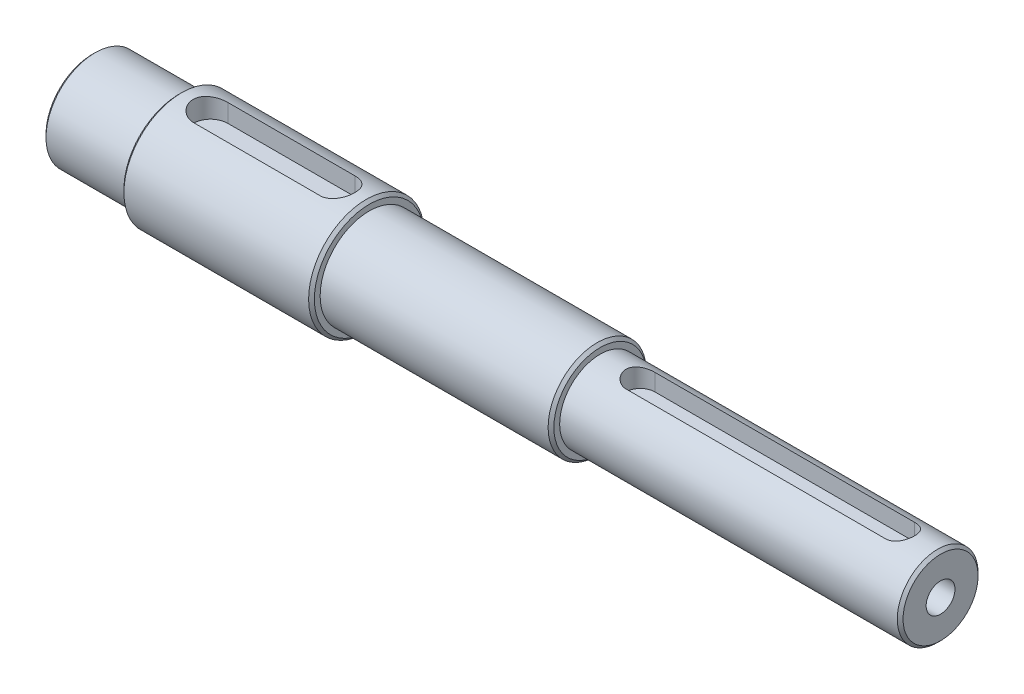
from build123d import *

# Parameters (mm, degrees)
CUT_EXTRUDE1_DEPTH    = 10
CUT_EXTRUDE2_DEPTH    = 10
CHAMFER1_SIZE         = 0.5
M6_TAPPED_HOLE1_D     = 5
M6_TAPPED_HOLE1_DEPTH = 15
M6_TAPPED_HOLE1_TIP   = 1.502151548


with BuildPart() as part:
    # Sketch1 → Revolve1 (revolve)
    with BuildSketch(Plane.XY, mode=Mode.PRIVATE) as revolve1_sk:
        Polygon((-78.230088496, 0), (-78.230088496, 8.5), (-63.230088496, 8.5), (-63.230088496, 10), (-30.230088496, 10), (-30.230088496, 8.5), (9.769911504, 8.5), (9.769911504, 7), (68.769911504, 7), (68.769911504, 0), align=None)
    revolve(revolve1_sk.sketch.rotate(Axis((-85.902654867, 0, 0), (1, 0, 0)), 90), axis=Axis((-85.902654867, 0, 0), (1, 0, 0)))

    # Sketch2 → Cut-Extrude1 (cut)
    with BuildSketch(Plane(origin=(0, 6.4, 0), x_dir=(1, 0, 0), z_dir=(0, 1, 0))):
        with BuildLine():
            Line((-35.730088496, -3), (-57.730088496, -3))
            ThreePointArc((-57.730088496, -3), (-60.730088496, 0), (-57.730088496, 3))
            Line((-57.730088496, 3), (-35.730088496, 3))
            ThreePointArc((-35.730088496, 3), (-32.730088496, 0), (-35.730088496, -3))
        make_face()
    extrude(amount=CUT_EXTRUDE1_DEPTH, mode=Mode.SUBTRACT)

    # Sketch3 → Cut-Extrude2 (cut)
    with BuildSketch(Plane(origin=(0, 3.6, 0), x_dir=(1, 0, 0), z_dir=(0, 1, 0))):
        with BuildLine():
            Line((16.769911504, 2.5), (61.769911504, 2.5))
            ThreePointArc((61.769911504, 2.5), (64.269911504, 0), (61.769911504, -2.5))
            Line((61.769911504, -2.5), (16.769911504, -2.5))
            ThreePointArc((16.769911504, -2.5), (14.269911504, 0), (16.769911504, 2.5))
        make_face()
    extrude(amount=CUT_EXTRUDE2_DEPTH, mode=Mode.SUBTRACT)

    # Chamfer1
    chamfer1_edges = [part.edges().sort_by_distance(p)[0] for p in [
        (-30.230088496, 0, -10),
        (-63.230088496, 0, -10),
        (-78.230088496, 0, -8.5),
        (68.769911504, 0, -7),
        (9.769911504, 0, -8.5),
    ]]
    chamfer(chamfer1_edges, length=CHAMFER1_SIZE)

    # M6 Tapped Hole1
    with Locations(Plane(origin=(68.769911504, 0, 0), x_dir=(0, 0, -1), z_dir=(1, 0, 0))):
        with Locations((0, 0)):
            Hole(M6_TAPPED_HOLE1_D / 2, depth=M6_TAPPED_HOLE1_DEPTH)
            with Locations((0, 0, -(M6_TAPPED_HOLE1_DEPTH + M6_TAPPED_HOLE1_TIP / 2))):  # 118° drill point
                Cone(0, M6_TAPPED_HOLE1_D / 2, M6_TAPPED_HOLE1_TIP, mode=Mode.SUBTRACT)


solid = part.part
